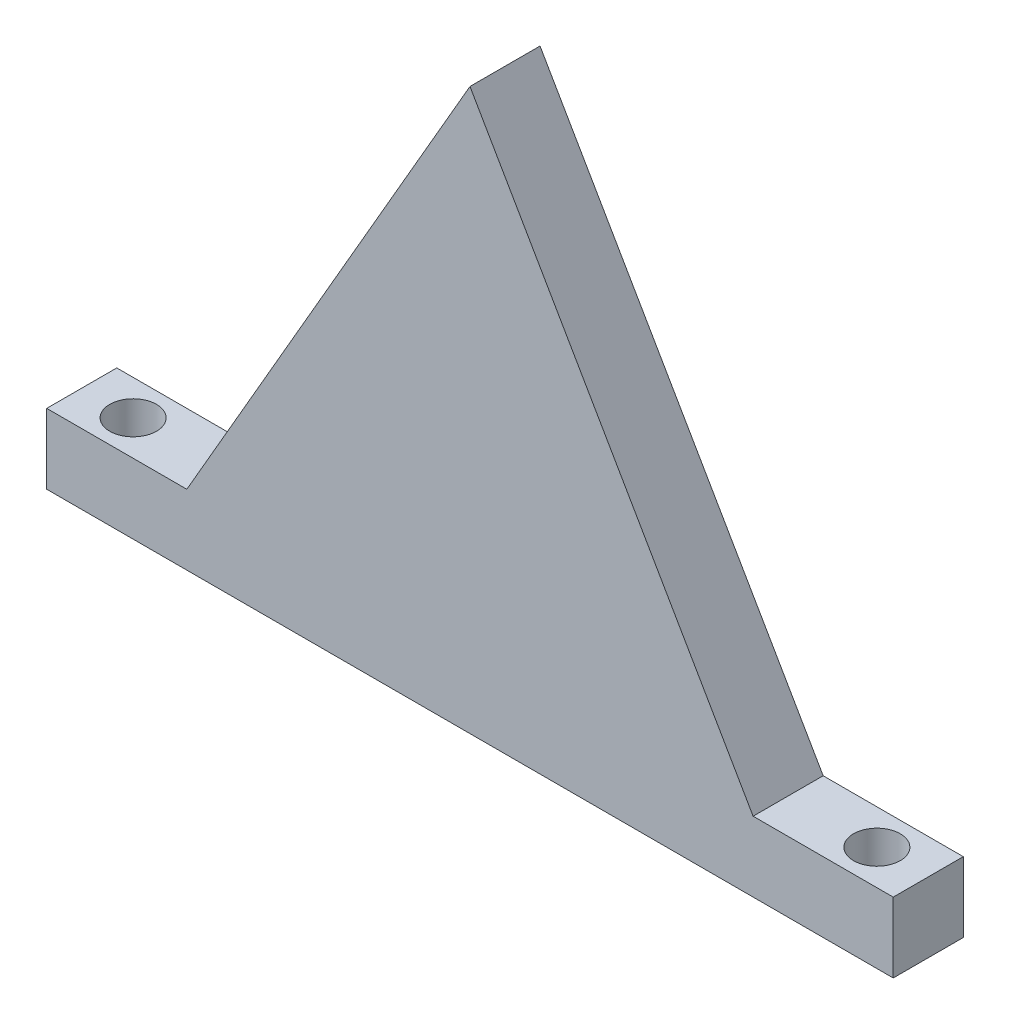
ISO-10303-21;
HEADER;
FILE_DESCRIPTION(('STEP AP214'),'2;1');
FILE_NAME('part.step','',(''),(''),'','','');
FILE_SCHEMA(('AUTOMOTIVE_DESIGN { 1 0 10303 214 1 1 1 1 }'));
ENDSEC;
DATA;
#1=APPLICATION_CONTEXT('core data for automotive mechanical design processes');
#2=APPLICATION_PROTOCOL_DEFINITION('international standard','automotive_design',2000,#1);
#3=PRODUCT_CONTEXT('',#1,'mechanical');
#4=PRODUCT('Part','Part','',(#3));
#5=PRODUCT_RELATED_PRODUCT_CATEGORY('part','',(#4));
#6=PRODUCT_DEFINITION_FORMATION('','',#4);
#7=PRODUCT_DEFINITION_CONTEXT('part definition',#1,'design');
#8=PRODUCT_DEFINITION('design','',#6,#7);
#9=PRODUCT_DEFINITION_SHAPE('','',#8);
#10=(LENGTH_UNIT() NAMED_UNIT(*) SI_UNIT(.MILLI.,.METRE.));
#11=(NAMED_UNIT(*) PLANE_ANGLE_UNIT() SI_UNIT($,.RADIAN.));
#12=(NAMED_UNIT(*) SI_UNIT($,.STERADIAN.) SOLID_ANGLE_UNIT());
#13=UNCERTAINTY_MEASURE_WITH_UNIT(LENGTH_MEASURE(1.E-05),#10,'distance_accuracy_value','');
#14=(GEOMETRIC_REPRESENTATION_CONTEXT(3) GLOBAL_UNCERTAINTY_ASSIGNED_CONTEXT((#13)) GLOBAL_UNIT_ASSIGNED_CONTEXT((#10,
#11,#12)) REPRESENTATION_CONTEXT('',''));
#15=CARTESIAN_POINT('',(0.,0.,0.));
#16=DIRECTION('',(0.,0.,1.));
#17=DIRECTION('',(1.,0.,0.));
#18=AXIS2_PLACEMENT_3D('',#15,#16,#17);
#19=CARTESIAN_POINT('',(0.,0.,9.525));
#20=DIRECTION('',(0.,1.,0.));
#21=DIRECTION('',(0.,0.,1.));
#22=AXIS2_PLACEMENT_3D('',#19,#20,#21);
#23=PLANE('',#22);
#24=CARTESIAN_POINT('',(-101.119658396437,0.,0.));
#25=DIRECTION('',(0.,-1.,0.));
#26=DIRECTION('',(1.,0.,0.));
#27=AXIS2_PLACEMENT_3D('',#24,#25,#26);
#28=CIRCLE('',#27,6.35);
#29=CARTESIAN_POINT('',(-94.7696583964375,0.,0.));
#30=VERTEX_POINT('',#29);
#31=EDGE_CURVE('E137',#30,#30,#28,.T.);
#32=ORIENTED_EDGE('',*,*,#31,.F.);
#33=EDGE_LOOP('',(#32));
#34=FACE_BOUND('',#33,.T.);
#35=CARTESIAN_POINT('',(101.119658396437,0.,0.));
#36=DIRECTION('',(0.,1.,0.));
#37=DIRECTION('',(-1.,0.,0.));
#38=AXIS2_PLACEMENT_3D('',#35,#36,#37);
#39=CIRCLE('',#38,6.35);
#40=CARTESIAN_POINT('',(94.7696583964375,0.,0.));
#41=VERTEX_POINT('',#40);
#42=EDGE_CURVE('E144',#41,#41,#39,.T.);
#43=ORIENTED_EDGE('',*,*,#42,.T.);
#44=EDGE_LOOP('',(#43));
#45=FACE_BOUND('',#44,.T.);
#46=DIRECTION('',(1.,0.,0.));
#47=VECTOR('',#46,1.);
#48=CARTESIAN_POINT('',(0.,0.,-9.525));
#49=LINE('',#48,#47);
#50=CARTESIAN_POINT('',(-115.089658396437,0.,-9.525));
#51=VERTEX_POINT('',#50);
#52=CARTESIAN_POINT('',(115.089658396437,0.,-9.525));
#53=VERTEX_POINT('',#52);
#54=EDGE_CURVE('E147',#51,#53,#49,.T.);
#55=ORIENTED_EDGE('',*,*,#54,.T.);
#56=DIRECTION('',(0.,0.,-1.));
#57=VECTOR('',#56,1.);
#58=CARTESIAN_POINT('',(115.089658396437,0.,9.525));
#59=LINE('',#58,#57);
#60=CARTESIAN_POINT('',(115.089658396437,0.,9.525));
#61=VERTEX_POINT('',#60);
#62=EDGE_CURVE('E11',#61,#53,#59,.T.);
#63=ORIENTED_EDGE('',*,*,#62,.F.);
#64=DIRECTION('',(1.,0.,0.));
#65=VECTOR('',#64,1.);
#66=CARTESIAN_POINT('',(0.,0.,9.525));
#67=LINE('',#66,#65);
#68=CARTESIAN_POINT('',(-115.089658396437,0.,9.525));
#69=VERTEX_POINT('',#68);
#70=EDGE_CURVE('E85',#69,#61,#67,.T.);
#71=ORIENTED_EDGE('',*,*,#70,.F.);
#72=DIRECTION('',(0.,0.,-1.));
#73=VECTOR('',#72,1.);
#74=CARTESIAN_POINT('',(-115.089658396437,0.,9.525));
#75=LINE('',#74,#73);
#76=EDGE_CURVE('E131',#69,#51,#75,.T.);
#77=ORIENTED_EDGE('',*,*,#76,.T.);
#78=EDGE_LOOP('',(#55,#63,#71,#77));
#79=FACE_BOUND('',#78,.T.);
#80=ADVANCED_FACE('F41',(#34,#45,#79),#23,.F.);
#81=CARTESIAN_POINT('',(115.089658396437,0.,9.525));
#82=DIRECTION('',(-1.,0.,0.));
#83=DIRECTION('',(0.,0.,1.));
#84=AXIS2_PLACEMENT_3D('',#81,#82,#83);
#85=PLANE('',#84);
#86=DIRECTION('',(0.,1.,0.));
#87=VECTOR('',#86,1.);
#88=CARTESIAN_POINT('',(115.089658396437,0.,-9.525));
#89=LINE('',#88,#87);
#90=CARTESIAN_POINT('',(115.089658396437,19.05,-9.525));
#91=VERTEX_POINT('',#90);
#92=EDGE_CURVE('E71',#53,#91,#89,.T.);
#93=ORIENTED_EDGE('',*,*,#92,.T.);
#94=DIRECTION('',(0.,0.,-1.));
#95=VECTOR('',#94,1.);
#96=CARTESIAN_POINT('',(115.089658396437,19.05,9.525));
#97=LINE('',#96,#95);
#98=CARTESIAN_POINT('',(115.089658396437,19.05,9.525));
#99=VERTEX_POINT('',#98);
#100=EDGE_CURVE('E49',#99,#91,#97,.T.);
#101=ORIENTED_EDGE('',*,*,#100,.F.);
#102=DIRECTION('',(0.,1.,0.));
#103=VECTOR('',#102,1.);
#104=CARTESIAN_POINT('',(115.089658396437,0.,9.525));
#105=LINE('',#104,#103);
#106=EDGE_CURVE('E151',#61,#99,#105,.T.);
#107=ORIENTED_EDGE('',*,*,#106,.F.);
#108=ORIENTED_EDGE('',*,*,#62,.T.);
#109=EDGE_LOOP('',(#93,#101,#107,#108));
#110=FACE_BOUND('',#109,.T.);
#111=ADVANCED_FACE('F180',(#110),#85,.F.);
#112=CARTESIAN_POINT('',(115.089658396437,19.05,9.525));
#113=DIRECTION('',(0.,-1.,0.));
#114=DIRECTION('',(1.,0.,0.));
#115=AXIS2_PLACEMENT_3D('',#112,#113,#114);
#116=PLANE('',#115);
#117=CARTESIAN_POINT('',(101.119658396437,19.05,0.));
#118=DIRECTION('',(0.,1.,0.));
#119=DIRECTION('',(-1.,0.,0.));
#120=AXIS2_PLACEMENT_3D('',#117,#118,#119);
#121=CIRCLE('',#120,6.35);
#122=CARTESIAN_POINT('',(94.7696583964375,19.05,0.));
#123=VERTEX_POINT('',#122);
#124=EDGE_CURVE('E119',#123,#123,#121,.T.);
#125=ORIENTED_EDGE('',*,*,#124,.F.);
#126=EDGE_LOOP('',(#125));
#127=FACE_BOUND('',#126,.T.);
#128=DIRECTION('',(-1.,0.,0.));
#129=VECTOR('',#128,1.);
#130=CARTESIAN_POINT('',(115.089658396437,19.05,-9.525));
#131=LINE('',#130,#129);
#132=CARTESIAN_POINT('',(76.9896583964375,19.05,-9.525));
#133=VERTEX_POINT('',#132);
#134=EDGE_CURVE('E78',#91,#133,#131,.T.);
#135=ORIENTED_EDGE('',*,*,#134,.T.);
#136=DIRECTION('',(0.,0.,-1.));
#137=VECTOR('',#136,1.);
#138=CARTESIAN_POINT('',(76.9896583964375,19.05,9.525));
#139=LINE('',#138,#137);
#140=CARTESIAN_POINT('',(76.9896583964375,19.05,9.525));
#141=VERTEX_POINT('',#140);
#142=EDGE_CURVE('E163',#141,#133,#139,.T.);
#143=ORIENTED_EDGE('',*,*,#142,.F.);
#144=DIRECTION('',(-1.,0.,0.));
#145=VECTOR('',#144,1.);
#146=CARTESIAN_POINT('',(115.089658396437,19.05,9.525));
#147=LINE('',#146,#145);
#148=EDGE_CURVE('E154',#99,#141,#147,.T.);
#149=ORIENTED_EDGE('',*,*,#148,.F.);
#150=ORIENTED_EDGE('',*,*,#100,.T.);
#151=EDGE_LOOP('',(#135,#143,#149,#150));
#152=FACE_BOUND('',#151,.T.);
#153=ADVANCED_FACE('F165',(#127,#152),#116,.F.);
#154=CARTESIAN_POINT('',(76.9896583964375,19.05,9.525));
#155=DIRECTION('',(-0.866025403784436,-0.500000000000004,0.));
#156=DIRECTION('',(0.500000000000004,-0.866025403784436,0.));
#157=AXIS2_PLACEMENT_3D('',#154,#155,#156);
#158=PLANE('',#157);
#159=DIRECTION('',(-0.500000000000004,0.866025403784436,0.));
#160=VECTOR('',#159,1.);
#161=CARTESIAN_POINT('',(76.9896583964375,19.05,-9.525));
#162=LINE('',#161,#160);
#163=CARTESIAN_POINT('',(0.,152.4,-9.525));
#164=VERTEX_POINT('',#163);
#165=EDGE_CURVE('E152',#133,#164,#162,.T.);
#166=ORIENTED_EDGE('',*,*,#165,.T.);
#167=DIRECTION('',(0.,0.,-1.));
#168=VECTOR('',#167,1.);
#169=CARTESIAN_POINT('',(0.,152.4,9.525));
#170=LINE('',#169,#168);
#171=CARTESIAN_POINT('',(0.,152.4,9.525));
#172=VERTEX_POINT('',#171);
#173=EDGE_CURVE('E157',#172,#164,#170,.T.);
#174=ORIENTED_EDGE('',*,*,#173,.F.);
#175=DIRECTION('',(-0.500000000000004,0.866025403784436,0.));
#176=VECTOR('',#175,1.);
#177=CARTESIAN_POINT('',(76.9896583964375,19.05,9.525));
#178=LINE('',#177,#176);
#179=EDGE_CURVE('E57',#141,#172,#178,.T.);
#180=ORIENTED_EDGE('',*,*,#179,.F.);
#181=ORIENTED_EDGE('',*,*,#142,.T.);
#182=EDGE_LOOP('',(#166,#174,#180,#181));
#183=FACE_BOUND('',#182,.T.);
#184=ADVANCED_FACE('F171',(#183),#158,.F.);
#185=CARTESIAN_POINT('',(0.,0.,9.525));
#186=DIRECTION('',(0.,0.,1.));
#187=DIRECTION('',(1.,0.,0.));
#188=AXIS2_PLACEMENT_3D('',#185,#186,#187);
#189=PLANE('',#188);
#190=ORIENTED_EDGE('',*,*,#179,.T.);
#191=DIRECTION('',(0.500000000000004,0.866025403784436,0.));
#192=VECTOR('',#191,1.);
#193=CARTESIAN_POINT('',(-76.9896583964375,19.05,9.525));
#194=LINE('',#193,#192);
#195=CARTESIAN_POINT('',(-76.9896583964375,19.05,9.525));
#196=VERTEX_POINT('',#195);
#197=EDGE_CURVE('E112',#196,#172,#194,.T.);
#198=ORIENTED_EDGE('',*,*,#197,.F.);
#199=DIRECTION('',(1.,0.,0.));
#200=VECTOR('',#199,1.);
#201=CARTESIAN_POINT('',(-115.089658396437,19.05,9.525));
#202=LINE('',#201,#200);
#203=CARTESIAN_POINT('',(-115.089658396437,19.05,9.525));
#204=VERTEX_POINT('',#203);
#205=EDGE_CURVE('E124',#204,#196,#202,.T.);
#206=ORIENTED_EDGE('',*,*,#205,.F.);
#207=DIRECTION('',(0.,1.,0.));
#208=VECTOR('',#207,1.);
#209=CARTESIAN_POINT('',(-115.089658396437,0.,9.525));
#210=LINE('',#209,#208);
#211=EDGE_CURVE('E129',#69,#204,#210,.T.);
#212=ORIENTED_EDGE('',*,*,#211,.F.);
#213=ORIENTED_EDGE('',*,*,#70,.T.);
#214=ORIENTED_EDGE('',*,*,#106,.T.);
#215=ORIENTED_EDGE('',*,*,#148,.T.);
#216=EDGE_LOOP('',(#190,#198,#206,#212,#213,#214,#215));
#217=FACE_BOUND('',#216,.T.);
#218=ADVANCED_FACE('F123',(#217),#189,.T.);
#219=CARTESIAN_POINT('',(0.,0.,-9.525));
#220=DIRECTION('',(0.,0.,1.));
#221=DIRECTION('',(1.,0.,0.));
#222=AXIS2_PLACEMENT_3D('',#219,#220,#221);
#223=PLANE('',#222);
#224=ORIENTED_EDGE('',*,*,#54,.F.);
#225=DIRECTION('',(0.,1.,0.));
#226=VECTOR('',#225,1.);
#227=CARTESIAN_POINT('',(-115.089658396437,0.,-9.525));
#228=LINE('',#227,#226);
#229=CARTESIAN_POINT('',(-115.089658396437,19.05,-9.525));
#230=VERTEX_POINT('',#229);
#231=EDGE_CURVE('E126',#51,#230,#228,.T.);
#232=ORIENTED_EDGE('',*,*,#231,.T.);
#233=DIRECTION('',(1.,0.,0.));
#234=VECTOR('',#233,1.);
#235=CARTESIAN_POINT('',(-115.089658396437,19.05,-9.525));
#236=LINE('',#235,#234);
#237=CARTESIAN_POINT('',(-76.9896583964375,19.05,-9.525));
#238=VERTEX_POINT('',#237);
#239=EDGE_CURVE('E136',#230,#238,#236,.T.);
#240=ORIENTED_EDGE('',*,*,#239,.T.);
#241=DIRECTION('',(0.500000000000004,0.866025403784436,0.));
#242=VECTOR('',#241,1.);
#243=CARTESIAN_POINT('',(-76.9896583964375,19.05,-9.525));
#244=LINE('',#243,#242);
#245=EDGE_CURVE('E114',#238,#164,#244,.T.);
#246=ORIENTED_EDGE('',*,*,#245,.T.);
#247=ORIENTED_EDGE('',*,*,#165,.F.);
#248=ORIENTED_EDGE('',*,*,#134,.F.);
#249=ORIENTED_EDGE('',*,*,#92,.F.);
#250=EDGE_LOOP('',(#224,#232,#240,#246,#247,#248,#249));
#251=FACE_BOUND('',#250,.T.);
#252=ADVANCED_FACE('F169',(#251),#223,.F.);
#253=CARTESIAN_POINT('',(101.119658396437,0.,0.));
#254=DIRECTION('',(0.,1.,0.));
#255=DIRECTION('',(-1.,0.,0.));
#256=AXIS2_PLACEMENT_3D('',#253,#254,#255);
#257=CYLINDRICAL_SURFACE('',#256,6.35);
#258=ORIENTED_EDGE('',*,*,#42,.F.);
#259=EDGE_LOOP('',(#258));
#260=FACE_BOUND('',#259,.T.);
#261=ORIENTED_EDGE('',*,*,#124,.T.);
#262=EDGE_LOOP('',(#261));
#263=FACE_BOUND('',#262,.T.);
#264=ADVANCED_FACE('F212',(#260,#263),#257,.F.);
#265=CARTESIAN_POINT('',(-76.9896583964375,19.05,9.525));
#266=DIRECTION('',(-0.866025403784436,0.500000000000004,0.));
#267=DIRECTION('',(-0.500000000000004,-0.866025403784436,0.));
#268=AXIS2_PLACEMENT_3D('',#265,#266,#267);
#269=PLANE('',#268);
#270=ORIENTED_EDGE('',*,*,#245,.F.);
#271=DIRECTION('',(0.,0.,-1.));
#272=VECTOR('',#271,1.);
#273=CARTESIAN_POINT('',(-76.9896583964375,19.05,9.525));
#274=LINE('',#273,#272);
#275=EDGE_CURVE('E109',#196,#238,#274,.T.);
#276=ORIENTED_EDGE('',*,*,#275,.F.);
#277=ORIENTED_EDGE('',*,*,#197,.T.);
#278=ORIENTED_EDGE('',*,*,#173,.T.);
#279=EDGE_LOOP('',(#270,#276,#277,#278));
#280=FACE_BOUND('',#279,.T.);
#281=ADVANCED_FACE('F110',(#280),#269,.T.);
#282=CARTESIAN_POINT('',(-115.089658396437,19.05,9.525));
#283=DIRECTION('',(0.,1.,0.));
#284=DIRECTION('',(-1.,0.,0.));
#285=AXIS2_PLACEMENT_3D('',#282,#283,#284);
#286=PLANE('',#285);
#287=CARTESIAN_POINT('',(-101.119658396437,19.05,0.));
#288=DIRECTION('',(0.,-1.,0.));
#289=DIRECTION('',(1.,0.,0.));
#290=AXIS2_PLACEMENT_3D('',#287,#288,#289);
#291=CIRCLE('',#290,6.35);
#292=CARTESIAN_POINT('',(-94.7696583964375,19.05,0.));
#293=VERTEX_POINT('',#292);
#294=EDGE_CURVE('E288',#293,#293,#291,.T.);
#295=ORIENTED_EDGE('',*,*,#294,.T.);
#296=EDGE_LOOP('',(#295));
#297=FACE_BOUND('',#296,.T.);
#298=ORIENTED_EDGE('',*,*,#239,.F.);
#299=DIRECTION('',(0.,0.,-1.));
#300=VECTOR('',#299,1.);
#301=CARTESIAN_POINT('',(-115.089658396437,19.05,9.525));
#302=LINE('',#301,#300);
#303=EDGE_CURVE('E120',#204,#230,#302,.T.);
#304=ORIENTED_EDGE('',*,*,#303,.F.);
#305=ORIENTED_EDGE('',*,*,#205,.T.);
#306=ORIENTED_EDGE('',*,*,#275,.T.);
#307=EDGE_LOOP('',(#298,#304,#305,#306));
#308=FACE_BOUND('',#307,.T.);
#309=ADVANCED_FACE('F128',(#297,#308),#286,.T.);
#310=CARTESIAN_POINT('',(-115.089658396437,0.,9.525));
#311=DIRECTION('',(-1.,0.,0.));
#312=DIRECTION('',(0.,0.,1.));
#313=AXIS2_PLACEMENT_3D('',#310,#311,#312);
#314=PLANE('',#313);
#315=ORIENTED_EDGE('',*,*,#231,.F.);
#316=ORIENTED_EDGE('',*,*,#76,.F.);
#317=ORIENTED_EDGE('',*,*,#211,.T.);
#318=ORIENTED_EDGE('',*,*,#303,.T.);
#319=EDGE_LOOP('',(#315,#316,#317,#318));
#320=FACE_BOUND('',#319,.T.);
#321=ADVANCED_FACE('F197',(#320),#314,.T.);
#322=CARTESIAN_POINT('',(-101.119658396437,0.,0.));
#323=DIRECTION('',(0.,1.,0.));
#324=DIRECTION('',(-1.,0.,0.));
#325=AXIS2_PLACEMENT_3D('',#322,#323,#324);
#326=CYLINDRICAL_SURFACE('',#325,6.35);
#327=ORIENTED_EDGE('',*,*,#31,.T.);
#328=EDGE_LOOP('',(#327));
#329=FACE_BOUND('',#328,.T.);
#330=ORIENTED_EDGE('',*,*,#294,.F.);
#331=EDGE_LOOP('',(#330));
#332=FACE_BOUND('',#331,.T.);
#333=ADVANCED_FACE('F199',(#329,#332),#326,.F.);
#334=CLOSED_SHELL('',(#80,#111,#153,#184,#218,#252,#264,#281,#309,#321,#333));
#335=MANIFOLD_SOLID_BREP('B2',#334);
#336=ADVANCED_BREP_SHAPE_REPRESENTATION('',(#18,#335),#14);
#337=SHAPE_DEFINITION_REPRESENTATION(#9,#336);
ENDSEC;
END-ISO-10303-21;
